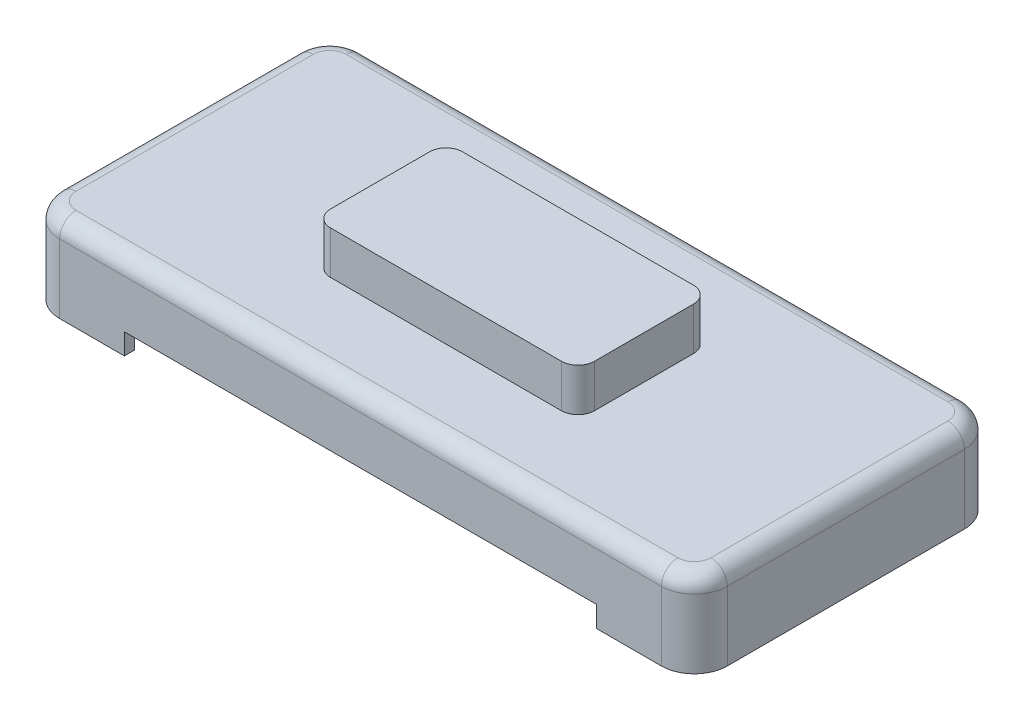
from build123d import *
from OCP.BRepFilletAPI import BRepFilletAPI_MakeFillet

# Parameters (mm, degrees)
SKETCH1_W               = 202.452941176
SKETCH1_H               = 91.888235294
EXTRUDE1_DEPTH          = 25.924906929
FILLET1_R1              = 5
FILLET1_R2              = 10
SHELL1_T                = -3
CUT_EXTRUDE1_DEPTH      = 115.147978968
CUT_EXTRUDE1_DEPTH_BACK = 115.147978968
SKETCH2_W               = 143.148544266
SKETCH2_H               = 6.346344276
RIB2_REACH              = 114.082
SKETCH3_WALLS_W         = 409.009619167
SKETCH3_WALLS_H         = 3
SKETCH3_WALLS_W_2       = 3
SKETCH3_WALLS_H_2       = 298.941620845
SKETCH3_WALLS_H_3       = 301.046746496
SKETCH5_W               = 80
SKETCH5_H               = 30
EXTRUDE2_DEPTH          = 20
FILLET2_R               = 5


with BuildPart() as part:
    # Sketch1 → Extrude1 (new body)
    with BuildSketch(Plane(origin=(0, 0, 0), x_dir=(1, 0, 0), z_dir=(0, 1, 0))):
        Rectangle(SKETCH1_W, SKETCH1_H)
    extrude(amount=EXTRUDE1_DEPTH)

    # Fillet1: one fillet with a radius per group of edges: ONE call of the kernel's fillet builder (fillet() takes one radius for all edges)
    fillet1_edges_1 = [part.edges().sort_by_distance(p)[0] for p in [
        (101.226470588, 25.924906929, 0),
        (0, 25.924906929, -45.944117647),
        (-101.226470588, 25.924906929, 0),
        (0, 25.924906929, 45.944117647),
    ]]
    fillet1_edges_2 = [part.edges().sort_by_distance(p)[0] for p in [
        (-101.226470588, 12.962453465, -45.944117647),
        (101.226470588, 12.962453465, -45.944117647),
        (101.226470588, 12.962453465, 45.944117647),
        (-101.226470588, 12.962453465, 45.944117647),
    ]]
    fillet1 = BRepFilletAPI_MakeFillet(part.part.solid().wrapped)
    for e in fillet1_edges_1:
        fillet1.Add(FILLET1_R1, e.wrapped)
    for e in fillet1_edges_2:
        fillet1.Add(FILLET1_R2, e.wrapped)
    add(Compound.cast(fillet1.Shape()), mode=Mode.REPLACE)

    # Shell1
    shell1_openings = [part.faces().sort_by_distance(p)[0] for p in [
        (0, 0, 0),
    ]]
    offset(amount=SHELL1_T, openings=shell1_openings, kind=Kind.INTERSECTION)

    # Sketch2 → Cut-Extrude1 (cut, two sides: drawn at the far end of the back side and taken through both)
    with BuildSketch(Plane.XY.offset(-CUT_EXTRUDE1_DEPTH_BACK)):
        with Locations((0, 3.173172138)):
            Rectangle(SKETCH2_W, SKETCH2_H)
    extrude(amount=CUT_EXTRUDE1_DEPTH + CUT_EXTRUDE1_DEPTH_BACK, mode=Mode.SUBTRACT)

    # Sketch3 walls → Rib2 (add, up to next)
    with BuildSketch(Plane(origin=(0, 11.615418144, 0), x_dir=(-1, 0, 0), z_dir=(0, 1, 0)), mode=Mode.PRIVATE) as rib2_sk1:
        with Locations((0.902196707, 27.968097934)):
            Rectangle(SKETCH3_WALLS_W, SKETCH3_WALLS_H)
    rib2_tool1 = extrude(rib2_sk1.sketch, amount=RIB2_REACH, mode=Mode.PRIVATE) - part.part
    # Sketch3 walls → Rib2 (add, up to next)
    with BuildSketch(Plane(origin=(0, 11.615418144, 0), x_dir=(-1, 0, 0), z_dir=(0, 1, 0)), mode=Mode.PRIVATE) as rib2_sk2:
        with Locations((0.902196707, 0)):
            Rectangle(SKETCH3_WALLS_W, SKETCH3_WALLS_H)
    rib2_tool2 = extrude(rib2_sk2.sketch, amount=RIB2_REACH, mode=Mode.PRIVATE) - part.part
    # Sketch3 walls → Rib2 (add, up to next)
    with BuildSketch(Plane(origin=(0, 11.615418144, 0), x_dir=(-1, 0, 0), z_dir=(0, 1, 0)), mode=Mode.PRIVATE) as rib2_sk3:
        with Locations((0.902196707, -27.968097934)):
            Rectangle(SKETCH3_WALLS_W, SKETCH3_WALLS_H)
    rib2_tool3 = extrude(rib2_sk3.sketch, amount=RIB2_REACH, mode=Mode.PRIVATE) - part.part
    # Sketch3 walls → Rib2 (add, up to next)
    with BuildSketch(Plane(origin=(0, 11.615418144, 0), x_dir=(-1, 0, 0), z_dir=(0, 1, 0)), mode=Mode.PRIVATE) as rib2_sk4:
        with Locations((51.425212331, 0.902196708)):
            Rectangle(SKETCH3_WALLS_W_2, SKETCH3_WALLS_H_2)
    rib2_tool4 = extrude(rib2_sk4.sketch, amount=RIB2_REACH, mode=Mode.PRIVATE) - part.part
    # Sketch3 walls → Rib2 (add, up to next)
    with BuildSketch(Plane(origin=(0, 11.615418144, 0), x_dir=(-1, 0, 0), z_dir=(0, 1, 0)), mode=Mode.PRIVATE) as rib2_sk5:
        with Locations((-51.425212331, 0.902196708)):
            Rectangle(SKETCH3_WALLS_W_2, SKETCH3_WALLS_H_2)
    rib2_tool5 = extrude(rib2_sk5.sketch, amount=RIB2_REACH, mode=Mode.PRIVATE) - part.part
    # Sketch3 walls → Rib2 (add, up to next)
    with BuildSketch(Plane(origin=(0, 11.615418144, 0), x_dir=(-1, 0, 0), z_dir=(0, 1, 0)), mode=Mode.PRIVATE) as rib2_sk6:
        with Locations((0, -0.150366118)):
            Rectangle(SKETCH3_WALLS_W_2, SKETCH3_WALLS_H_3)
    rib2_tool6 = extrude(rib2_sk6.sketch, amount=RIB2_REACH, mode=Mode.PRIVATE) - part.part
    add(rib2_tool1.solids().sort_by_distance((-0.902196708, 11.615418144, 27.968097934))[0])
    add(rib2_tool2.solids().sort_by_distance((-0.902196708, 11.615418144, 0))[0])
    add(rib2_tool3.solids().sort_by_distance((-0.902196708, 11.615418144, -27.968097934))[0])
    add(rib2_tool4.solids().sort_by_distance((-51.425212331, 11.615418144, 0.902196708))[0])
    add(rib2_tool5.solids().sort_by_distance((51.425212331, 11.615418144, 0.902196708))[0])
    add(rib2_tool6.solids().sort_by_distance((0, 11.615418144, -0.150366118))[0])


with BuildPart() as body_2:
    # Sketch5 → Extrude2 (new, symmetric)
    with BuildSketch(Plane.XY):
        with Locations((0, 23.924906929)):
            Rectangle(SKETCH5_W, SKETCH5_H)
    extrude(amount=EXTRUDE2_DEPTH, both=True)

    # Fillet2
    fillet2_edges = [body_2.edges().sort_by_distance(p)[0] for p in [
        (40, 23.924906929, 20),
        (-40, 23.924906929, 20),
        (40, 23.924906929, -20),
        (0, 8.924906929, -20),
        (-40, 23.924906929, -20),
        (0, 8.924906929, 20),
        (40, 8.924906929, 0),
        (-40, 8.924906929, 0),
    ]]
    fillet(fillet2_edges, radius=FILLET2_R)


solid = Compound([part.part, body_2.part])
